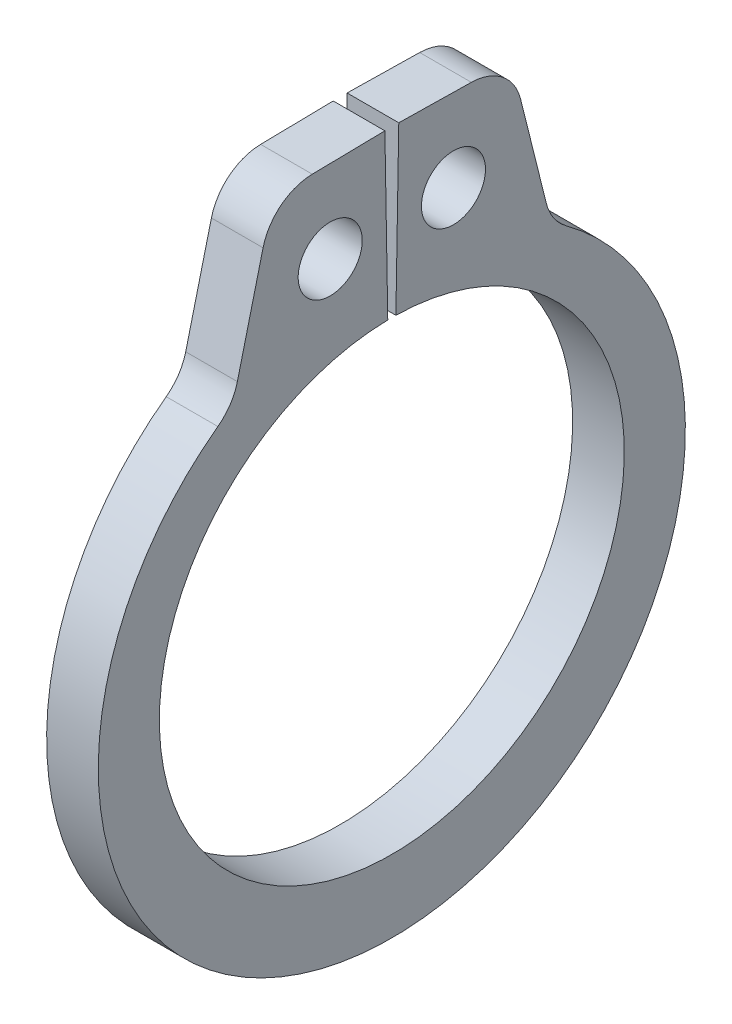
from build123d import *

# Parameters (mm, degrees)
SKETCH1_R      = 0.3937
EXTRUDE1_DEPTH = 0.3175
FILLET1_R      = 0.635


with BuildPart() as part:
    # Sketch1 → Extrude1 (new, symmetric)
    with BuildSketch(Plane(origin=(0, 0, 0), x_dir=(0, 0, -1), z_dir=(1, 0, 0))):
        with BuildLine():
            Line((-0.049870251, 2.857064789), (-0.085333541, 4.888755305))
            Line((-0.085333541, 4.888755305), (-1.464919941, 4.864674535))
            Line((-1.464919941, 4.864674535), (-1.956505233, 2.893033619))
            ThreePointArc((-1.956505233, 2.893033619), (0, -3.7465), (1.956505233, 2.893033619))
            Line((1.956505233, 2.893033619), (1.464919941, 4.864674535))
            Line((1.464919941, 4.864674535), (0.085333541, 4.888755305))
            Line((0.085333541, 4.888755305), (0.049870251, 2.857064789))
            ThreePointArc((0.049870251, 2.857064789), (0, -2.8575), (-0.049870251, 2.857064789))
        make_face()
        with Locations((-0.757395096, 3.860869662)):
            Circle(SKETCH1_R, mode=Mode.SUBTRACT)
        with Locations((0.757395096, 3.860869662)):
            Circle(SKETCH1_R, mode=Mode.SUBTRACT)
    extrude(amount=EXTRUDE1_DEPTH, both=True)

    # Fillet1
    fillet1_edges = [part.edges().sort_by_distance(p)[0] for p in [
        (0, 4.864674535, -1.464919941),
        (0, 2.893033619, -1.956505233),
        (0, 2.893033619, 1.956505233),
        (0, 4.864674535, 1.464919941),
    ]]
    fillet(fillet1_edges, radius=FILLET1_R)


solid = part.part
